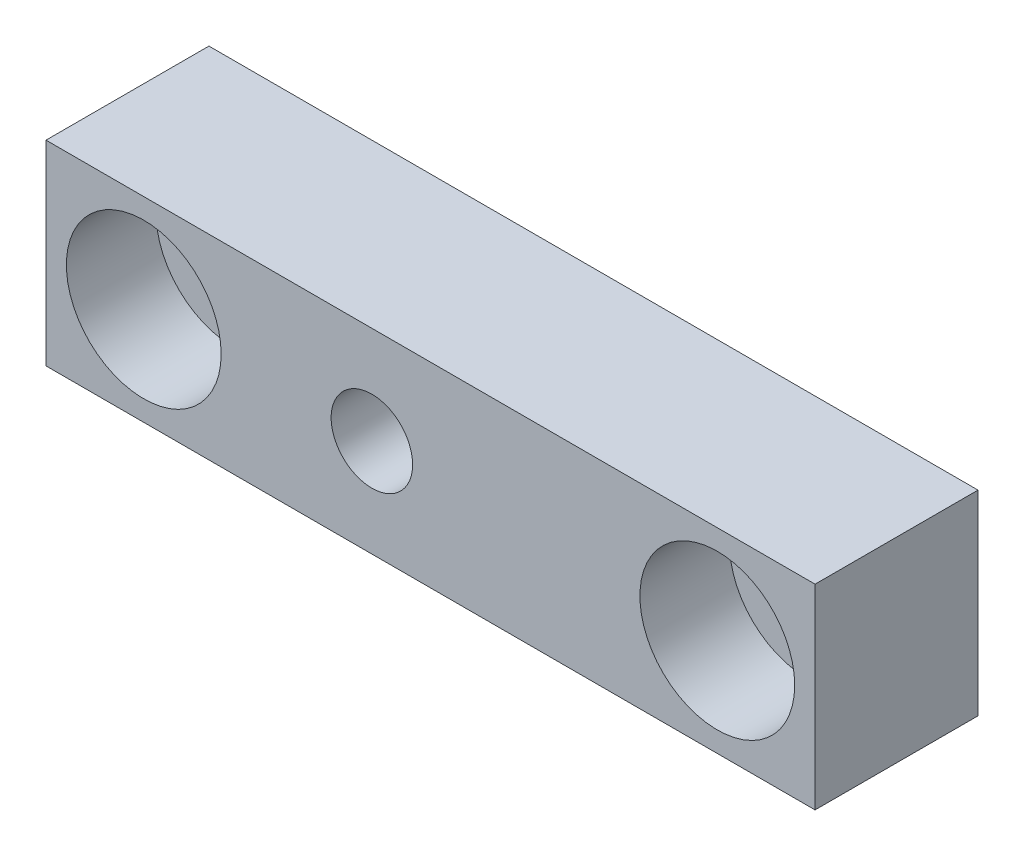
ISO-10303-21;
HEADER;
FILE_DESCRIPTION(('STEP AP214'),'2;1');
FILE_NAME('part.step','',(''),(''),'','','');
FILE_SCHEMA(('AUTOMOTIVE_DESIGN { 1 0 10303 214 1 1 1 1 }'));
ENDSEC;
DATA;
#1=APPLICATION_CONTEXT('core data for automotive mechanical design processes');
#2=APPLICATION_PROTOCOL_DEFINITION('international standard','automotive_design',2000,#1);
#3=PRODUCT_CONTEXT('',#1,'mechanical');
#4=PRODUCT('Part','Part','',(#3));
#5=PRODUCT_RELATED_PRODUCT_CATEGORY('part','',(#4));
#6=PRODUCT_DEFINITION_FORMATION('','',#4);
#7=PRODUCT_DEFINITION_CONTEXT('part definition',#1,'design');
#8=PRODUCT_DEFINITION('design','',#6,#7);
#9=PRODUCT_DEFINITION_SHAPE('','',#8);
#10=(LENGTH_UNIT() NAMED_UNIT(*) SI_UNIT(.MILLI.,.METRE.));
#11=(NAMED_UNIT(*) PLANE_ANGLE_UNIT() SI_UNIT($,.RADIAN.));
#12=(NAMED_UNIT(*) SI_UNIT($,.STERADIAN.) SOLID_ANGLE_UNIT());
#13=UNCERTAINTY_MEASURE_WITH_UNIT(LENGTH_MEASURE(1.E-05),#10,'distance_accuracy_value','');
#14=(GEOMETRIC_REPRESENTATION_CONTEXT(3) GLOBAL_UNCERTAINTY_ASSIGNED_CONTEXT((#13)) GLOBAL_UNIT_ASSIGNED_CONTEXT((#10,
#11,#12)) REPRESENTATION_CONTEXT('',''));
#15=CARTESIAN_POINT('',(0.,0.,0.));
#16=DIRECTION('',(0.,0.,1.));
#17=DIRECTION('',(1.,0.,0.));
#18=AXIS2_PLACEMENT_3D('',#15,#16,#17);
#19=CARTESIAN_POINT('',(6.,6.,10.));
#20=DIRECTION('',(0.,0.,-1.));
#21=DIRECTION('',(-1.,0.,0.));
#22=AXIS2_PLACEMENT_3D('',#19,#20,#21);
#23=CYLINDRICAL_SURFACE('',#22,2.75);
#24=CARTESIAN_POINT('',(6.,6.,0.));
#25=DIRECTION('',(0.,0.,1.));
#26=DIRECTION('',(1.,0.,0.));
#27=AXIS2_PLACEMENT_3D('',#24,#25,#26);
#28=CIRCLE('',#27,2.75);
#29=CARTESIAN_POINT('',(8.75,6.,0.));
#30=VERTEX_POINT('',#29);
#31=EDGE_CURVE('E129',#30,#30,#28,.T.);
#32=ORIENTED_EDGE('',*,*,#31,.F.);
#33=EDGE_LOOP('',(#32));
#34=FACE_BOUND('',#33,.T.);
#35=CARTESIAN_POINT('',(6.,6.,4.5));
#36=DIRECTION('',(0.,0.,1.));
#37=DIRECTION('',(1.,0.,0.));
#38=AXIS2_PLACEMENT_3D('',#35,#36,#37);
#39=CIRCLE('',#38,2.75);
#40=CARTESIAN_POINT('',(8.75,6.,4.5));
#41=VERTEX_POINT('',#40);
#42=EDGE_CURVE('E36',#41,#41,#39,.T.);
#43=ORIENTED_EDGE('',*,*,#42,.T.);
#44=EDGE_LOOP('',(#43));
#45=FACE_BOUND('',#44,.T.);
#46=ADVANCED_FACE('F32',(#34,#45),#23,.F.);
#47=CARTESIAN_POINT('',(41.1999999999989,6.,10.));
#48=DIRECTION('',(0.,0.,-1.));
#49=DIRECTION('',(-1.,0.,0.));
#50=AXIS2_PLACEMENT_3D('',#47,#48,#49);
#51=CYLINDRICAL_SURFACE('',#50,2.75);
#52=CARTESIAN_POINT('',(41.1999999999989,6.,0.));
#53=DIRECTION('',(0.,0.,1.));
#54=DIRECTION('',(1.,0.,0.));
#55=AXIS2_PLACEMENT_3D('',#52,#53,#54);
#56=CIRCLE('',#55,2.75);
#57=CARTESIAN_POINT('',(43.9499999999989,6.,0.));
#58=VERTEX_POINT('',#57);
#59=EDGE_CURVE('E103',#58,#58,#56,.T.);
#60=ORIENTED_EDGE('',*,*,#59,.F.);
#61=EDGE_LOOP('',(#60));
#62=FACE_BOUND('',#61,.T.);
#63=CARTESIAN_POINT('',(41.1999999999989,6.,4.5));
#64=DIRECTION('',(0.,0.,1.));
#65=DIRECTION('',(1.,0.,0.));
#66=AXIS2_PLACEMENT_3D('',#63,#64,#65);
#67=CIRCLE('',#66,2.75);
#68=CARTESIAN_POINT('',(43.9499999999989,6.,4.5));
#69=VERTEX_POINT('',#68);
#70=EDGE_CURVE('E108',#69,#69,#67,.T.);
#71=ORIENTED_EDGE('',*,*,#70,.T.);
#72=EDGE_LOOP('',(#71));
#73=FACE_BOUND('',#72,.T.);
#74=ADVANCED_FACE('F139',(#62,#73),#51,.F.);
#75=CARTESIAN_POINT('',(0.,12.,10.));
#76=DIRECTION('',(0.,0.,-1.));
#77=DIRECTION('',(-1.,0.,0.));
#78=AXIS2_PLACEMENT_3D('',#75,#76,#77);
#79=PLANE('',#78);
#80=CARTESIAN_POINT('',(6.,6.,10.));
#81=DIRECTION('',(0.,0.,1.));
#82=DIRECTION('',(1.,0.,0.));
#83=AXIS2_PLACEMENT_3D('',#80,#81,#82);
#84=CIRCLE('',#83,4.75);
#85=CARTESIAN_POINT('',(10.75,6.,10.));
#86=VERTEX_POINT('',#85);
#87=EDGE_CURVE('E125',#86,#86,#84,.T.);
#88=ORIENTED_EDGE('',*,*,#87,.F.);
#89=EDGE_LOOP('',(#88));
#90=FACE_BOUND('',#89,.T.);
#91=CARTESIAN_POINT('',(41.1999999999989,6.,10.));
#92=DIRECTION('',(0.,0.,1.));
#93=DIRECTION('',(1.,0.,0.));
#94=AXIS2_PLACEMENT_3D('',#91,#92,#93);
#95=CIRCLE('',#94,4.75);
#96=CARTESIAN_POINT('',(45.9499999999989,6.,10.));
#97=VERTEX_POINT('',#96);
#98=EDGE_CURVE('E118',#97,#97,#95,.T.);
#99=ORIENTED_EDGE('',*,*,#98,.F.);
#100=EDGE_LOOP('',(#99));
#101=FACE_BOUND('',#100,.T.);
#102=DIRECTION('',(0.,-1.,0.));
#103=VECTOR('',#102,1.);
#104=CARTESIAN_POINT('',(0.,0.,10.));
#105=LINE('',#104,#103);
#106=CARTESIAN_POINT('',(0.,12.,10.));
#107=VERTEX_POINT('',#106);
#108=CARTESIAN_POINT('',(0.,0.,10.));
#109=VERTEX_POINT('',#108);
#110=EDGE_CURVE('E87',#107,#109,#105,.T.);
#111=ORIENTED_EDGE('',*,*,#110,.T.);
#112=DIRECTION('',(1.,0.,0.));
#113=VECTOR('',#112,1.);
#114=CARTESIAN_POINT('',(0.,0.,10.));
#115=LINE('',#114,#113);
#116=CARTESIAN_POINT('',(47.1999999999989,0.,10.));
#117=VERTEX_POINT('',#116);
#118=EDGE_CURVE('E81',#109,#117,#115,.T.);
#119=ORIENTED_EDGE('',*,*,#118,.T.);
#120=DIRECTION('',(0.,1.,0.));
#121=VECTOR('',#120,1.);
#122=CARTESIAN_POINT('',(47.1999999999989,0.,10.));
#123=LINE('',#122,#121);
#124=CARTESIAN_POINT('',(47.1999999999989,12.,10.));
#125=VERTEX_POINT('',#124);
#126=EDGE_CURVE('E85',#117,#125,#123,.T.);
#127=ORIENTED_EDGE('',*,*,#126,.T.);
#128=DIRECTION('',(-1.,0.,0.));
#129=VECTOR('',#128,1.);
#130=CARTESIAN_POINT('',(0.,12.,10.));
#131=LINE('',#130,#129);
#132=EDGE_CURVE('E51',#125,#107,#131,.T.);
#133=ORIENTED_EDGE('',*,*,#132,.T.);
#134=EDGE_LOOP('',(#111,#119,#127,#133));
#135=FACE_BOUND('',#134,.T.);
#136=CARTESIAN_POINT('',(20.,6.,10.));
#137=DIRECTION('',(0.,0.,1.));
#138=DIRECTION('',(1.,0.,0.));
#139=AXIS2_PLACEMENT_3D('',#136,#137,#138);
#140=CIRCLE('',#139,2.5);
#141=CARTESIAN_POINT('',(22.5,6.,10.));
#142=VERTEX_POINT('',#141);
#143=EDGE_CURVE('E115',#142,#142,#140,.T.);
#144=ORIENTED_EDGE('',*,*,#143,.F.);
#145=EDGE_LOOP('',(#144));
#146=FACE_BOUND('',#145,.T.);
#147=ADVANCED_FACE('F82',(#90,#101,#135,#146),#79,.F.);
#148=CARTESIAN_POINT('',(0.,12.,0.));
#149=DIRECTION('',(0.,0.,-1.));
#150=DIRECTION('',(-1.,0.,0.));
#151=AXIS2_PLACEMENT_3D('',#148,#149,#150);
#152=PLANE('',#151);
#153=ORIENTED_EDGE('',*,*,#31,.T.);
#154=EDGE_LOOP('',(#153));
#155=FACE_BOUND('',#154,.T.);
#156=DIRECTION('',(0.,-1.,0.));
#157=VECTOR('',#156,1.);
#158=CARTESIAN_POINT('',(0.,0.,0.));
#159=LINE('',#158,#157);
#160=CARTESIAN_POINT('',(0.,12.,0.));
#161=VERTEX_POINT('',#160);
#162=CARTESIAN_POINT('',(0.,0.,0.));
#163=VERTEX_POINT('',#162);
#164=EDGE_CURVE('E100',#161,#163,#159,.T.);
#165=ORIENTED_EDGE('',*,*,#164,.F.);
#166=DIRECTION('',(-1.,0.,0.));
#167=VECTOR('',#166,1.);
#168=CARTESIAN_POINT('',(0.,12.,0.));
#169=LINE('',#168,#167);
#170=CARTESIAN_POINT('',(47.1999999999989,12.,0.));
#171=VERTEX_POINT('',#170);
#172=EDGE_CURVE('E74',#171,#161,#169,.T.);
#173=ORIENTED_EDGE('',*,*,#172,.F.);
#174=DIRECTION('',(0.,1.,0.));
#175=VECTOR('',#174,1.);
#176=CARTESIAN_POINT('',(47.1999999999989,0.,0.));
#177=LINE('',#176,#175);
#178=CARTESIAN_POINT('',(47.1999999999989,0.,0.));
#179=VERTEX_POINT('',#178);
#180=EDGE_CURVE('E68',#179,#171,#177,.T.);
#181=ORIENTED_EDGE('',*,*,#180,.F.);
#182=DIRECTION('',(1.,0.,0.));
#183=VECTOR('',#182,1.);
#184=CARTESIAN_POINT('',(0.,0.,0.));
#185=LINE('',#184,#183);
#186=EDGE_CURVE('E91',#163,#179,#185,.T.);
#187=ORIENTED_EDGE('',*,*,#186,.F.);
#188=EDGE_LOOP('',(#165,#173,#181,#187));
#189=FACE_BOUND('',#188,.T.);
#190=ORIENTED_EDGE('',*,*,#59,.T.);
#191=EDGE_LOOP('',(#190));
#192=FACE_BOUND('',#191,.T.);
#193=CARTESIAN_POINT('',(20.,6.,0.));
#194=DIRECTION('',(0.,0.,1.));
#195=DIRECTION('',(1.,0.,0.));
#196=AXIS2_PLACEMENT_3D('',#193,#194,#195);
#197=CIRCLE('',#196,2.5);
#198=CARTESIAN_POINT('',(22.5,6.,0.));
#199=VERTEX_POINT('',#198);
#200=EDGE_CURVE('E110',#199,#199,#197,.T.);
#201=ORIENTED_EDGE('',*,*,#200,.T.);
#202=EDGE_LOOP('',(#201));
#203=FACE_BOUND('',#202,.T.);
#204=ADVANCED_FACE('F136',(#155,#189,#192,#203),#152,.T.);
#205=CARTESIAN_POINT('',(0.,0.,10.));
#206=DIRECTION('',(1.,0.,0.));
#207=DIRECTION('',(0.,0.,-1.));
#208=AXIS2_PLACEMENT_3D('',#205,#206,#207);
#209=PLANE('',#208);
#210=ORIENTED_EDGE('',*,*,#164,.T.);
#211=DIRECTION('',(0.,0.,-1.));
#212=VECTOR('',#211,1.);
#213=CARTESIAN_POINT('',(0.,0.,10.));
#214=LINE('',#213,#212);
#215=EDGE_CURVE('E11',#109,#163,#214,.T.);
#216=ORIENTED_EDGE('',*,*,#215,.F.);
#217=ORIENTED_EDGE('',*,*,#110,.F.);
#218=DIRECTION('',(0.,0.,-1.));
#219=VECTOR('',#218,1.);
#220=CARTESIAN_POINT('',(0.,12.,10.));
#221=LINE('',#220,#219);
#222=EDGE_CURVE('E96',#107,#161,#221,.T.);
#223=ORIENTED_EDGE('',*,*,#222,.T.);
#224=EDGE_LOOP('',(#210,#216,#217,#223));
#225=FACE_BOUND('',#224,.T.);
#226=ADVANCED_FACE('F34',(#225),#209,.F.);
#227=CARTESIAN_POINT('',(0.,0.,10.));
#228=DIRECTION('',(0.,1.,0.));
#229=DIRECTION('',(0.,0.,1.));
#230=AXIS2_PLACEMENT_3D('',#227,#228,#229);
#231=PLANE('',#230);
#232=ORIENTED_EDGE('',*,*,#186,.T.);
#233=DIRECTION('',(0.,0.,-1.));
#234=VECTOR('',#233,1.);
#235=CARTESIAN_POINT('',(47.1999999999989,0.,10.));
#236=LINE('',#235,#234);
#237=EDGE_CURVE('E42',#117,#179,#236,.T.);
#238=ORIENTED_EDGE('',*,*,#237,.F.);
#239=ORIENTED_EDGE('',*,*,#118,.F.);
#240=ORIENTED_EDGE('',*,*,#215,.T.);
#241=EDGE_LOOP('',(#232,#238,#239,#240));
#242=FACE_BOUND('',#241,.T.);
#243=ADVANCED_FACE('F90',(#242),#231,.F.);
#244=CARTESIAN_POINT('',(47.1999999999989,0.,10.));
#245=DIRECTION('',(-1.,0.,0.));
#246=DIRECTION('',(0.,0.,1.));
#247=AXIS2_PLACEMENT_3D('',#244,#245,#246);
#248=PLANE('',#247);
#249=ORIENTED_EDGE('',*,*,#180,.T.);
#250=DIRECTION('',(0.,0.,-1.));
#251=VECTOR('',#250,1.);
#252=CARTESIAN_POINT('',(47.1999999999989,12.,10.));
#253=LINE('',#252,#251);
#254=EDGE_CURVE('E92',#125,#171,#253,.T.);
#255=ORIENTED_EDGE('',*,*,#254,.F.);
#256=ORIENTED_EDGE('',*,*,#126,.F.);
#257=ORIENTED_EDGE('',*,*,#237,.T.);
#258=EDGE_LOOP('',(#249,#255,#256,#257));
#259=FACE_BOUND('',#258,.T.);
#260=ADVANCED_FACE('F94',(#259),#248,.F.);
#261=CARTESIAN_POINT('',(0.,12.,10.));
#262=DIRECTION('',(0.,-1.,0.));
#263=DIRECTION('',(0.,0.,-1.));
#264=AXIS2_PLACEMENT_3D('',#261,#262,#263);
#265=PLANE('',#264);
#266=ORIENTED_EDGE('',*,*,#172,.T.);
#267=ORIENTED_EDGE('',*,*,#222,.F.);
#268=ORIENTED_EDGE('',*,*,#132,.F.);
#269=ORIENTED_EDGE('',*,*,#254,.T.);
#270=EDGE_LOOP('',(#266,#267,#268,#269));
#271=FACE_BOUND('',#270,.T.);
#272=ADVANCED_FACE('F155',(#271),#265,.F.);
#273=CARTESIAN_POINT('',(20.,6.,10.));
#274=DIRECTION('',(0.,0.,-1.));
#275=DIRECTION('',(-1.,0.,0.));
#276=AXIS2_PLACEMENT_3D('',#273,#274,#275);
#277=CYLINDRICAL_SURFACE('',#276,2.5);
#278=ORIENTED_EDGE('',*,*,#143,.T.);
#279=EDGE_LOOP('',(#278));
#280=FACE_BOUND('',#279,.T.);
#281=ORIENTED_EDGE('',*,*,#200,.F.);
#282=EDGE_LOOP('',(#281));
#283=FACE_BOUND('',#282,.T.);
#284=ADVANCED_FACE('F158',(#280,#283),#277,.F.);
#285=CARTESIAN_POINT('',(41.1999999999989,6.,4.5));
#286=DIRECTION('',(0.,0.,1.));
#287=DIRECTION('',(1.,0.,0.));
#288=AXIS2_PLACEMENT_3D('',#285,#286,#287);
#289=CYLINDRICAL_SURFACE('',#288,4.75);
#290=CARTESIAN_POINT('',(41.1999999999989,6.,4.5));
#291=DIRECTION('',(0.,0.,1.));
#292=DIRECTION('',(1.,0.,0.));
#293=AXIS2_PLACEMENT_3D('',#290,#291,#292);
#294=CIRCLE('',#293,4.75);
#295=CARTESIAN_POINT('',(45.9499999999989,6.,4.5));
#296=VERTEX_POINT('',#295);
#297=EDGE_CURVE('E111',#296,#296,#294,.T.);
#298=ORIENTED_EDGE('',*,*,#297,.F.);
#299=EDGE_LOOP('',(#298));
#300=FACE_BOUND('',#299,.T.);
#301=ORIENTED_EDGE('',*,*,#98,.T.);
#302=EDGE_LOOP('',(#301));
#303=FACE_BOUND('',#302,.T.);
#304=ADVANCED_FACE('F185',(#300,#303),#289,.F.);
#305=CARTESIAN_POINT('',(41.1999999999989,6.,4.5));
#306=DIRECTION('',(0.,0.,1.));
#307=DIRECTION('',(1.,0.,0.));
#308=AXIS2_PLACEMENT_3D('',#305,#306,#307);
#309=PLANE('',#308);
#310=ORIENTED_EDGE('',*,*,#70,.F.);
#311=EDGE_LOOP('',(#310));
#312=FACE_BOUND('',#311,.T.);
#313=ORIENTED_EDGE('',*,*,#297,.T.);
#314=EDGE_LOOP('',(#313));
#315=FACE_BOUND('',#314,.T.);
#316=ADVANCED_FACE('F190',(#312,#315),#309,.T.);
#317=CARTESIAN_POINT('',(6.,6.,4.5));
#318=DIRECTION('',(0.,0.,1.));
#319=DIRECTION('',(1.,0.,0.));
#320=AXIS2_PLACEMENT_3D('',#317,#318,#319);
#321=CYLINDRICAL_SURFACE('',#320,4.75);
#322=CARTESIAN_POINT('',(6.,6.,4.5));
#323=DIRECTION('',(0.,0.,1.));
#324=DIRECTION('',(1.,0.,0.));
#325=AXIS2_PLACEMENT_3D('',#322,#323,#324);
#326=CIRCLE('',#325,4.75);
#327=CARTESIAN_POINT('',(10.75,6.,4.5));
#328=VERTEX_POINT('',#327);
#329=EDGE_CURVE('E267',#328,#328,#326,.T.);
#330=ORIENTED_EDGE('',*,*,#329,.F.);
#331=EDGE_LOOP('',(#330));
#332=FACE_BOUND('',#331,.T.);
#333=ORIENTED_EDGE('',*,*,#87,.T.);
#334=EDGE_LOOP('',(#333));
#335=FACE_BOUND('',#334,.T.);
#336=ADVANCED_FACE('F202',(#332,#335),#321,.F.);
#337=CARTESIAN_POINT('',(6.,6.,4.5));
#338=DIRECTION('',(0.,0.,1.));
#339=DIRECTION('',(1.,0.,0.));
#340=AXIS2_PLACEMENT_3D('',#337,#338,#339);
#341=PLANE('',#340);
#342=ORIENTED_EDGE('',*,*,#42,.F.);
#343=EDGE_LOOP('',(#342));
#344=FACE_BOUND('',#343,.T.);
#345=ORIENTED_EDGE('',*,*,#329,.T.);
#346=EDGE_LOOP('',(#345));
#347=FACE_BOUND('',#346,.T.);
#348=ADVANCED_FACE('F212',(#344,#347),#341,.T.);
#349=CLOSED_SHELL('',(#46,#74,#147,#204,#226,#243,#260,#272,#284,#304,#316,#336,#348));
#350=MANIFOLD_SOLID_BREP('B2',#349);
#351=ADVANCED_BREP_SHAPE_REPRESENTATION('',(#18,#350),#14);
#352=SHAPE_DEFINITION_REPRESENTATION(#9,#351);
ENDSEC;
END-ISO-10303-21;
